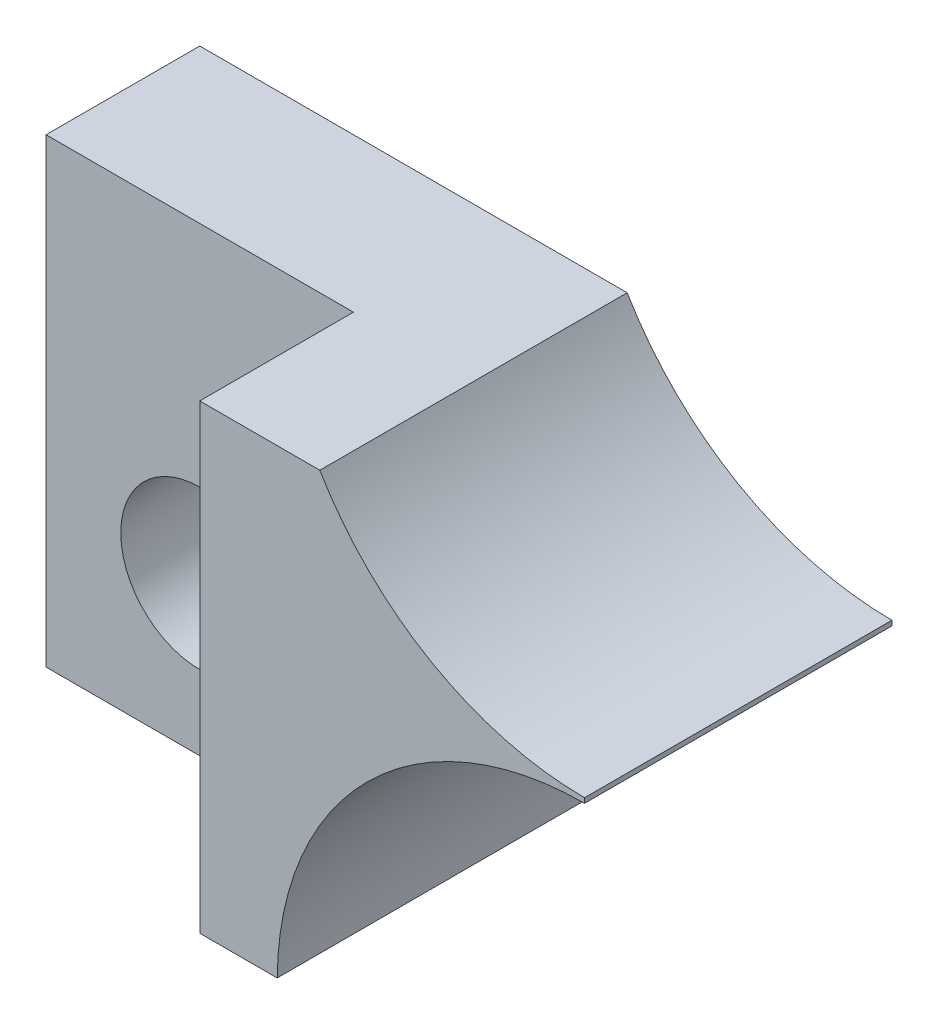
from build123d import *

# Parameters (mm, degrees)
SKETCH1_R           = 1.63195
EXTRUDE1_DEPTH      = 6.35
SKETCH5_W           = 15.98667914
SKETCH5_H           = 1.5875
CUT_EXTRUDE4_DEPTH  = 116.178567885
SKETCH6_W           = 6.35
SKETCH6_H           = 3.175
CUT_EXTRUDE5_DEPTH  = 116.178567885
CUT_EXTRUDE6_DEPTH  = 115.75110634
CUT_EXTRUDE7_DEPTH  = 115.871833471
SKETCH9_R           = 1.63195
CUT_EXTRUDE8_DEPTH  = 6.35
EXTRUDE2_DEPTH      = 10
EXTRUDE2_DEPTH_BACK = 116.178567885


with BuildPart() as part:
    # Sketch1 → Extrude1 (new body)
    with BuildSketch(Plane.XY):
        with BuildLine():
            Line((0, 9.525), (0, 0))
            Line((0, 0), (7.950403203, 0))
            ThreePointArc((7.950403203, 0), (12.65282779, 6.081790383), (19.769817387, 3.175))
            Line((19.769817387, 3.175), (91.355182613, 3.175))
            ThreePointArc((91.355182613, 3.175), (96.8248, 6.2992), (102.294417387, 3.175))
            Line((102.294417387, 3.175), (114.3, 3.175))
            Line((114.3, 3.175), (114.3, 12.7))
            Line((114.3, 12.7), (103.174596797, 12.7))
            ThreePointArc((103.174596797, 12.7), (98.47217221, 6.618209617), (91.355182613, 9.525))
            Line((91.355182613, 9.525), (19.769817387, 9.525))
            ThreePointArc((19.769817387, 9.525), (14.3002, 6.4008), (8.830582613, 9.525))
            Line((8.830582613, 9.525), (0, 9.525))
        make_face()
        with BuildLine():
            Line((109.22, 11.15695), (111.76, 11.15695))
            ThreePointArc((111.76, 11.15695), (113.39195, 9.525), (111.76, 7.89305))
            Line((111.76, 7.89305), (109.22, 7.89305))
            ThreePointArc((109.22, 7.89305), (107.58805, 9.525), (109.22, 11.15695))
        make_face(mode=Mode.SUBTRACT)
        with Locations(Location((3.175, 3.175, 0), (0, 0, 180))):
            Circle(SKETCH1_R, mode=Mode.SUBTRACT)
    extrude(amount=EXTRUDE1_DEPTH)

    # Sketch5 → Cut-Extrude4 (cut, through all)
    with BuildSketch(Plane(origin=(0, 0, 0), x_dir=(-1, 0, 0), z_dir=(0, 0, -1))):
        with Locations((-106.30666043, 3.96875)):
            Rectangle(SKETCH5_W, SKETCH5_H)
    extrude(amount=-CUT_EXTRUDE4_DEPTH, mode=Mode.SUBTRACT)

    # Sketch6 → Cut-Extrude5 (cut, through all)
    with BuildSketch(Plane.XZ):
        with Locations((3.175, 4.7625)):
            Rectangle(SKETCH6_W, SKETCH6_H)
    extrude(amount=-CUT_EXTRUDE5_DEPTH, mode=Mode.SUBTRACT)

    # Sketch7 → Cut-Extrude6 (cut, through all)
    with BuildSketch(Plane.XZ.offset(-4.7625)):
        with BuildLine():
            Line((114.3, 6.35), (104.775, 6.35))
            Line((104.775, 6.35), (104.775, 5.715))
            ThreePointArc((104.775, 5.715), (105.518948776, 3.918948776), (107.315, 3.175))
            Line((107.315, 3.175), (114.3, 3.175))
            Line((114.3, 3.175), (114.3, 6.35))
        make_face()
    extrude(amount=-CUT_EXTRUDE6_DEPTH, mode=Mode.SUBTRACT)

    # Sketch8 → Cut-Extrude7 (cut, through all)
    with BuildSketch(Plane.XZ.offset(-3.175)):
        with BuildLine():
            Line((25.4, 6.35), (25.4, 3.556))
            ThreePointArc((25.4, 3.556), (25.848403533, 5.182744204), (27.066958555, 6.35))
            Line((27.066958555, 6.35), (25.4, 6.35))
        make_face()
        with BuildLine():
            Line((31.75, 3.556), (31.75, 6.35))
            Line((31.75, 6.35), (30.083041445, 6.35))
            ThreePointArc((30.083041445, 6.35), (31.301596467, 5.182744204), (31.75, 3.556))
        make_face()
        with BuildLine():
            Line((25.4, 3.556), (31.75, 3.556))
            ThreePointArc((31.75, 3.556), (31.301596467, 5.182744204), (30.083041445, 6.35))
            Line((30.083041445, 6.35), (27.066958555, 6.35))
            ThreePointArc((27.066958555, 6.35), (25.848403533, 5.182744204), (25.4, 3.556))
        make_face()
        with BuildLine():
            ThreePointArc((25.4, 3.556), (28.575, 0.381), (31.75, 3.556))
            Line((31.75, 3.556), (25.4, 3.556))
        make_face()
        with BuildLine():
            Line((79.375, 6.35), (79.375, 3.556))
            ThreePointArc((79.375, 3.556), (79.823403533, 5.182744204), (81.041958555, 6.35))
            Line((81.041958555, 6.35), (79.375, 6.35))
        make_face()
        with BuildLine():
            Line((79.375, 3.556), (85.725, 3.556))
            ThreePointArc((85.725, 3.556), (85.276596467, 5.182744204), (84.058041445, 6.35))
            Line((84.058041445, 6.35), (81.041958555, 6.35))
            ThreePointArc((81.041958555, 6.35), (79.823403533, 5.182744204), (79.375, 3.556))
        make_face()
        with BuildLine():
            ThreePointArc((84.058041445, 6.35), (85.276596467, 5.182744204), (85.725, 3.556))
            Line((85.725, 3.556), (85.725, 6.35))
            Line((85.725, 6.35), (84.058041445, 6.35))
        make_face()
        with BuildLine():
            ThreePointArc((79.375, 3.556), (82.55, 0.381), (85.725, 3.556))
            Line((85.725, 3.556), (79.375, 3.556))
        make_face()
    extrude(amount=-CUT_EXTRUDE7_DEPTH, mode=Mode.SUBTRACT)

    # Sketch9 → Cut-Extrude8 (cut)
    with BuildSketch(Plane.XY.offset(6.35)):
        with Locations((39.37, 6.35)):
            Circle(SKETCH9_R)
        with Locations((74.93, 6.35)):
            Circle(SKETCH9_R)
    extrude(amount=-CUT_EXTRUDE8_DEPTH, mode=Mode.SUBTRACT)

    # Sketch10 → Extrude2 (cut, two sides: drawn at the far end of the back side and taken through both)
    with BuildSketch(Plane.XY.offset(6.35).offset(-EXTRUDE2_DEPTH_BACK)):
        Polygon((14.3002, 12.7508), (14.3002, -23.204967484), (128.929166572, -23.204967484), (128.929166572, 12.7508), (128.929166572, 25.4508), (14.3002, 25.4508), align=None)
    extrude(amount=EXTRUDE2_DEPTH + EXTRUDE2_DEPTH_BACK, mode=Mode.SUBTRACT)


solid = part.part
